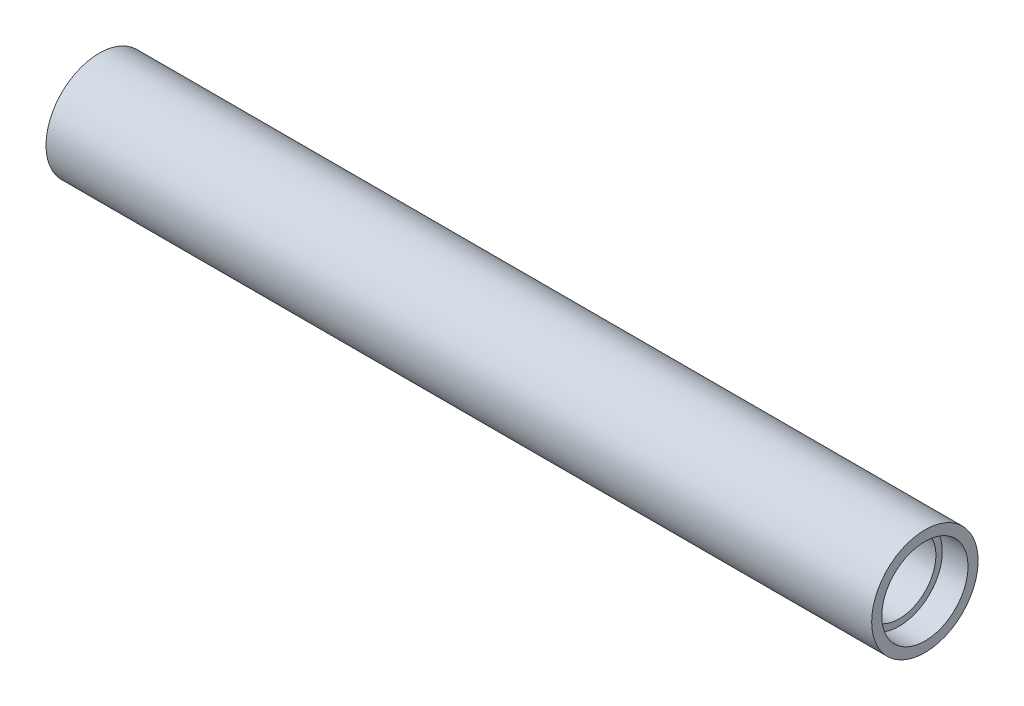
from build123d import *


with BuildPart() as part:
    # Esquisse1 → R_volution1 (revolve)
    with BuildSketch(Plane.XY, mode=Mode.PRIVATE) as r_volution1_sk:
        Polygon((-211, 20), (211, 20), (211, 23.5), (225, 23.5), (225, 29), (-225, 29), (-225, 23.5), (-211, 23.5), align=None)
    revolve(r_volution1_sk.sketch.rotate(Axis((-301.835158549, 0, 0), (1, 0, 0)), 90), axis=Axis((-301.835158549, 0, 0), (1, 0, 0)))


solid = part.part
